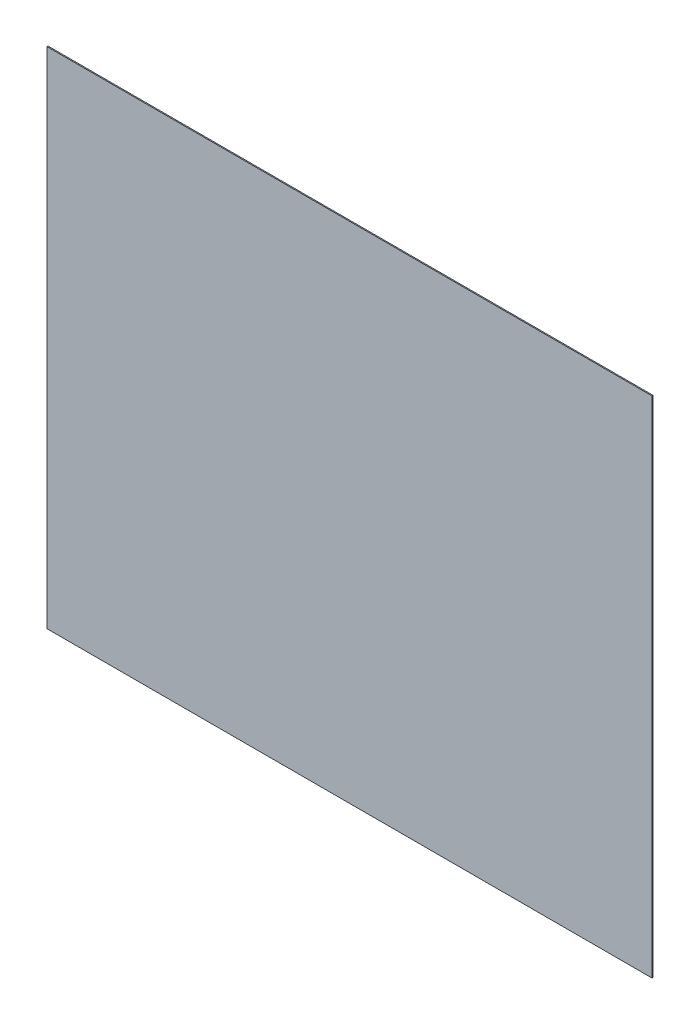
ISO-10303-21;
HEADER;
FILE_DESCRIPTION(('STEP AP214'),'2;1');
FILE_NAME('part.step','',(''),(''),'','','');
FILE_SCHEMA(('AUTOMOTIVE_DESIGN { 1 0 10303 214 1 1 1 1 }'));
ENDSEC;
DATA;
#1=APPLICATION_CONTEXT('core data for automotive mechanical design processes');
#2=APPLICATION_PROTOCOL_DEFINITION('international standard','automotive_design',2000,#1);
#3=PRODUCT_CONTEXT('',#1,'mechanical');
#4=PRODUCT('Part','Part','',(#3));
#5=PRODUCT_RELATED_PRODUCT_CATEGORY('part','',(#4));
#6=PRODUCT_DEFINITION_FORMATION('','',#4);
#7=PRODUCT_DEFINITION_CONTEXT('part definition',#1,'design');
#8=PRODUCT_DEFINITION('design','',#6,#7);
#9=PRODUCT_DEFINITION_SHAPE('','',#8);
#10=(LENGTH_UNIT() NAMED_UNIT(*) SI_UNIT(.MILLI.,.METRE.));
#11=(NAMED_UNIT(*) PLANE_ANGLE_UNIT() SI_UNIT($,.RADIAN.));
#12=(NAMED_UNIT(*) SI_UNIT($,.STERADIAN.) SOLID_ANGLE_UNIT());
#13=UNCERTAINTY_MEASURE_WITH_UNIT(LENGTH_MEASURE(1.E-05),#10,'distance_accuracy_value','');
#14=(GEOMETRIC_REPRESENTATION_CONTEXT(3) GLOBAL_UNCERTAINTY_ASSIGNED_CONTEXT((#13)) GLOBAL_UNIT_ASSIGNED_CONTEXT((#10,
#11,#12)) REPRESENTATION_CONTEXT('',''));
#15=CARTESIAN_POINT('',(0.,0.,0.));
#16=DIRECTION('',(0.,0.,1.));
#17=DIRECTION('',(1.,0.,0.));
#18=AXIS2_PLACEMENT_3D('',#15,#16,#17);
#19=CARTESIAN_POINT('',(1828.8,1524.,-6.35));
#20=DIRECTION('',(1.,0.,0.));
#21=DIRECTION('',(0.,1.,0.));
#22=AXIS2_PLACEMENT_3D('',#19,#20,#21);
#23=PLANE('',#22);
#24=DIRECTION('',(0.,1.,0.));
#25=VECTOR('',#24,1.);
#26=CARTESIAN_POINT('',(1828.8,1524.,0.));
#27=LINE('',#26,#25);
#28=CARTESIAN_POINT('',(1828.8,-1524.,0.));
#29=VERTEX_POINT('',#28);
#30=CARTESIAN_POINT('',(1828.8,1524.,0.));
#31=VERTEX_POINT('',#30);
#32=EDGE_CURVE('E100',#29,#31,#27,.T.);
#33=ORIENTED_EDGE('',*,*,#32,.F.);
#34=DIRECTION('',(0.,0.,1.));
#35=VECTOR('',#34,1.);
#36=CARTESIAN_POINT('',(1828.8,-1524.,-6.35));
#37=LINE('',#36,#35);
#38=CARTESIAN_POINT('',(1828.8,-1524.,-6.35));
#39=VERTEX_POINT('',#38);
#40=EDGE_CURVE('E11',#39,#29,#37,.T.);
#41=ORIENTED_EDGE('',*,*,#40,.F.);
#42=DIRECTION('',(0.,1.,0.));
#43=VECTOR('',#42,1.);
#44=CARTESIAN_POINT('',(1828.8,1524.,-6.35));
#45=LINE('',#44,#43);
#46=CARTESIAN_POINT('',(1828.8,1524.,-6.35));
#47=VERTEX_POINT('',#46);
#48=EDGE_CURVE('E93',#39,#47,#45,.T.);
#49=ORIENTED_EDGE('',*,*,#48,.T.);
#50=DIRECTION('',(0.,0.,1.));
#51=VECTOR('',#50,1.);
#52=CARTESIAN_POINT('',(1828.8,1524.,-6.35));
#53=LINE('',#52,#51);
#54=EDGE_CURVE('E37',#47,#31,#53,.T.);
#55=ORIENTED_EDGE('',*,*,#54,.T.);
#56=EDGE_LOOP('',(#33,#41,#49,#55));
#57=FACE_BOUND('',#56,.T.);
#58=ADVANCED_FACE('F34',(#57),#23,.T.);
#59=CARTESIAN_POINT('',(-1828.8,-1524.,-6.35));
#60=DIRECTION('',(0.,-1.,0.));
#61=DIRECTION('',(0.,0.,-1.));
#62=AXIS2_PLACEMENT_3D('',#59,#60,#61);
#63=PLANE('',#62);
#64=DIRECTION('',(1.,0.,0.));
#65=VECTOR('',#64,1.);
#66=CARTESIAN_POINT('',(-1828.8,-1524.,0.));
#67=LINE('',#66,#65);
#68=CARTESIAN_POINT('',(-1828.8,-1524.,0.));
#69=VERTEX_POINT('',#68);
#70=EDGE_CURVE('E96',#69,#29,#67,.T.);
#71=ORIENTED_EDGE('',*,*,#70,.F.);
#72=DIRECTION('',(0.,0.,1.));
#73=VECTOR('',#72,1.);
#74=CARTESIAN_POINT('',(-1828.8,-1524.,-6.35));
#75=LINE('',#74,#73);
#76=CARTESIAN_POINT('',(-1828.8,-1524.,-6.35));
#77=VERTEX_POINT('',#76);
#78=EDGE_CURVE('E43',#77,#69,#75,.T.);
#79=ORIENTED_EDGE('',*,*,#78,.F.);
#80=DIRECTION('',(1.,0.,0.));
#81=VECTOR('',#80,1.);
#82=CARTESIAN_POINT('',(-1828.8,-1524.,-6.35));
#83=LINE('',#82,#81);
#84=EDGE_CURVE('E89',#77,#39,#83,.T.);
#85=ORIENTED_EDGE('',*,*,#84,.T.);
#86=ORIENTED_EDGE('',*,*,#40,.T.);
#87=EDGE_LOOP('',(#71,#79,#85,#86));
#88=FACE_BOUND('',#87,.T.);
#89=ADVANCED_FACE('F110',(#88),#63,.T.);
#90=CARTESIAN_POINT('',(-1828.8,1524.,-6.35));
#91=DIRECTION('',(-1.,0.,0.));
#92=DIRECTION('',(0.,-1.,0.));
#93=AXIS2_PLACEMENT_3D('',#90,#91,#92);
#94=PLANE('',#93);
#95=DIRECTION('',(0.,-1.,0.));
#96=VECTOR('',#95,1.);
#97=CARTESIAN_POINT('',(-1828.8,1524.,0.));
#98=LINE('',#97,#96);
#99=CARTESIAN_POINT('',(-1828.8,1524.,0.));
#100=VERTEX_POINT('',#99);
#101=EDGE_CURVE('E84',#100,#69,#98,.T.);
#102=ORIENTED_EDGE('',*,*,#101,.F.);
#103=DIRECTION('',(0.,0.,1.));
#104=VECTOR('',#103,1.);
#105=CARTESIAN_POINT('',(-1828.8,1524.,-6.35));
#106=LINE('',#105,#104);
#107=CARTESIAN_POINT('',(-1828.8,1524.,-6.35));
#108=VERTEX_POINT('',#107);
#109=EDGE_CURVE('E79',#108,#100,#106,.T.);
#110=ORIENTED_EDGE('',*,*,#109,.F.);
#111=DIRECTION('',(0.,-1.,0.));
#112=VECTOR('',#111,1.);
#113=CARTESIAN_POINT('',(-1828.8,1524.,-6.35));
#114=LINE('',#113,#112);
#115=EDGE_CURVE('E82',#108,#77,#114,.T.);
#116=ORIENTED_EDGE('',*,*,#115,.T.);
#117=ORIENTED_EDGE('',*,*,#78,.T.);
#118=EDGE_LOOP('',(#102,#110,#116,#117));
#119=FACE_BOUND('',#118,.T.);
#120=ADVANCED_FACE('F81',(#119),#94,.T.);
#121=CARTESIAN_POINT('',(-1828.8,1524.,-6.35));
#122=DIRECTION('',(0.,1.,0.));
#123=DIRECTION('',(0.,0.,1.));
#124=AXIS2_PLACEMENT_3D('',#121,#122,#123);
#125=PLANE('',#124);
#126=DIRECTION('',(-1.,0.,0.));
#127=VECTOR('',#126,1.);
#128=CARTESIAN_POINT('',(-1828.8,1524.,0.));
#129=LINE('',#128,#127);
#130=EDGE_CURVE('E103',#31,#100,#129,.T.);
#131=ORIENTED_EDGE('',*,*,#130,.F.);
#132=ORIENTED_EDGE('',*,*,#54,.F.);
#133=DIRECTION('',(-1.,0.,0.));
#134=VECTOR('',#133,1.);
#135=CARTESIAN_POINT('',(-1828.8,1524.,-6.35));
#136=LINE('',#135,#134);
#137=EDGE_CURVE('E88',#47,#108,#136,.T.);
#138=ORIENTED_EDGE('',*,*,#137,.T.);
#139=ORIENTED_EDGE('',*,*,#109,.T.);
#140=EDGE_LOOP('',(#131,#132,#138,#139));
#141=FACE_BOUND('',#140,.T.);
#142=ADVANCED_FACE('F91',(#141),#125,.T.);
#143=CARTESIAN_POINT('',(1828.8,-1524.,-6.35));
#144=DIRECTION('',(0.,0.,1.));
#145=DIRECTION('',(1.,0.,0.));
#146=AXIS2_PLACEMENT_3D('',#143,#144,#145);
#147=PLANE('',#146);
#148=ORIENTED_EDGE('',*,*,#48,.F.);
#149=ORIENTED_EDGE('',*,*,#84,.F.);
#150=ORIENTED_EDGE('',*,*,#115,.F.);
#151=ORIENTED_EDGE('',*,*,#137,.F.);
#152=EDGE_LOOP('',(#148,#149,#150,#151));
#153=FACE_BOUND('',#152,.T.);
#154=ADVANCED_FACE('F87',(#153),#147,.F.);
#155=CARTESIAN_POINT('',(1828.8,-1524.,0.));
#156=DIRECTION('',(0.,0.,1.));
#157=DIRECTION('',(1.,0.,0.));
#158=AXIS2_PLACEMENT_3D('',#155,#156,#157);
#159=PLANE('',#158);
#160=ORIENTED_EDGE('',*,*,#32,.T.);
#161=ORIENTED_EDGE('',*,*,#130,.T.);
#162=ORIENTED_EDGE('',*,*,#101,.T.);
#163=ORIENTED_EDGE('',*,*,#70,.T.);
#164=EDGE_LOOP('',(#160,#161,#162,#163));
#165=FACE_BOUND('',#164,.T.);
#166=ADVANCED_FACE('F109',(#165),#159,.T.);
#167=CLOSED_SHELL('',(#58,#89,#120,#142,#154,#166));
#168=MANIFOLD_SOLID_BREP('B2',#167);
#169=ADVANCED_BREP_SHAPE_REPRESENTATION('',(#18,#168),#14);
#170=SHAPE_DEFINITION_REPRESENTATION(#9,#169);
ENDSEC;
END-ISO-10303-21;
